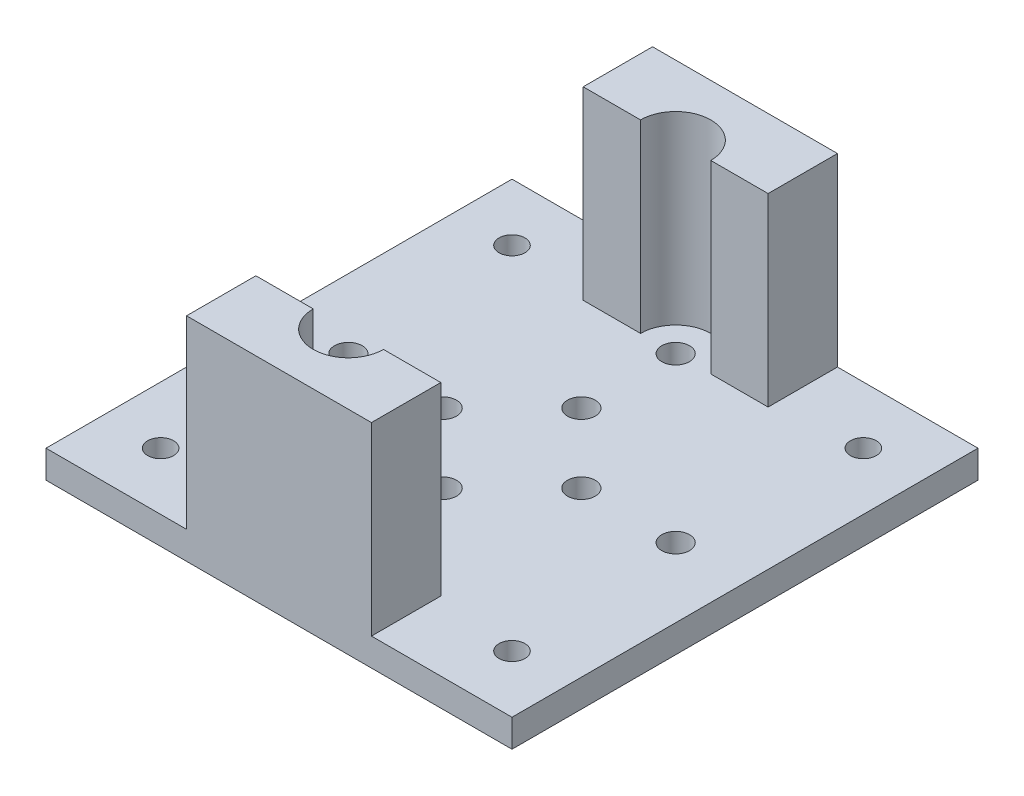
from build123d import *

# Parameters (mm, degrees)
SKETCH_2_W               = 50.4
SKETCH_2_H               = 50.4
EXTRUDE_1_DEPTH          = 3
CUT_EXTRUDE_1_DEPTH      = 36.764227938
CUT_EXTRUDE_1_DEPTH_BACK = 36.764227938
SKETCH_3_R               = 1.5
SKETCH_4_R               = 1.4
CUT_EXTRUDE_2_DEPTH      = 36.764227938
EXTRUDE_2_DEPTH          = 20
SKETCH_7_R               = 1.5
CUT_EXTRUDE_3_DEPTH      = 10


with BuildPart() as part:
    # Sketch 2 → Extrude 1 (new body)
    with BuildSketch(Plane(origin=(0, 0, 0), x_dir=(1, 0, 0), z_dir=(0, 1, 0))):
        Rectangle(SKETCH_2_W, SKETCH_2_H)
    extrude(amount=-EXTRUDE_1_DEPTH)

    # Sketch 3 → Cut-Extrude 1 (cut, two sides: drawn at the far end of the back side and taken through both)
    with BuildSketch(Plane(origin=(0, 0, 0), x_dir=(1, 0, 0), z_dir=(0, 1, 0)).offset(-CUT_EXTRUDE_1_DEPTH_BACK)):
        with Locations(Location((0, 17.7, 0), (0, 0, 270))):
            Circle(SKETCH_3_R)
        with Locations(Location((17.7, 0, 0), (0, 0, 270))):
            Circle(SKETCH_3_R)
        with Locations(Location((0, -17.7, 0), (0, 0, 270))):
            Circle(SKETCH_3_R)
        with Locations(Location((-17.7, 0, 0), (0, 0, 270))):
            Circle(SKETCH_3_R)
    extrude(amount=CUT_EXTRUDE_1_DEPTH + CUT_EXTRUDE_1_DEPTH_BACK, mode=Mode.SUBTRACT)

    # Sketch 4 → Cut-Extrude 2 (cut, through all)
    with BuildSketch(Plane(origin=(0, 0, 0), x_dir=(1, 0, 0), z_dir=(0, 1, 0))):
        with Locations(Location((-19, 19, 0), (0, 0, 270))):
            Circle(SKETCH_4_R)
        with Locations(Location((19, 19, 0), (0, 0, 270))):
            Circle(SKETCH_4_R)
        with Locations(Location((19, -19, 0), (0, 0, 270))):
            Circle(SKETCH_4_R)
        with Locations(Location((-19, -19, 0), (0, 0, 270))):
            Circle(SKETCH_4_R)
    extrude(amount=-CUT_EXTRUDE_2_DEPTH, mode=Mode.SUBTRACT)

    # Sketch 6 → Extrude 2 (add)
    with BuildSketch(Plane(origin=(0, 0, 0), x_dir=(1, 0, 0), z_dir=(0, 1, 0))):
        with BuildLine():
            Line((10, 17.7), (3.8, 17.7))
            ThreePointArc((3.8, 17.7), (0, 21.5), (-3.8, 17.7))
            Line((-3.8, 17.7), (-10, 17.7))
            Line((-10, 17.7), (-10, 25.2))
            Line((-10, 25.2), (10, 25.2))
            Line((10, 25.2), (10, 17.7))
        make_face()
        with BuildLine():
            Line((10, -17.7), (3.8, -17.7))
            ThreePointArc((3.8, -17.7), (0, -21.5), (-3.8, -17.7))
            Line((-3.8, -17.7), (-10, -17.7))
            Line((-10, -17.7), (-10, -25.2))
            Line((-10, -25.2), (10, -25.2))
            Line((10, -25.2), (10, -17.7))
        make_face()
    extrude(amount=EXTRUDE_2_DEPTH)

    # Sketch 7 → Cut-Extrude 3 (cut)
    with BuildSketch(Plane(origin=(0, 0, 0), x_dir=(1, 0, 0), z_dir=(0, 1, 0))):
        with Locations(Location((0, 7.5, 0), (0, 0, 270))):
            Circle(SKETCH_7_R)
        with Locations(Location((7.5, 0, 0), (0, 0, 270))):
            Circle(SKETCH_7_R)
        with Locations(Location((0, -7.5, 0), (0, 0, 270))):
            Circle(SKETCH_7_R)
        with Locations(Location((-7.5, 0, 0), (0, 0, 270))):
            Circle(SKETCH_7_R)
    extrude(amount=-CUT_EXTRUDE_3_DEPTH, mode=Mode.SUBTRACT)


solid = part.part
